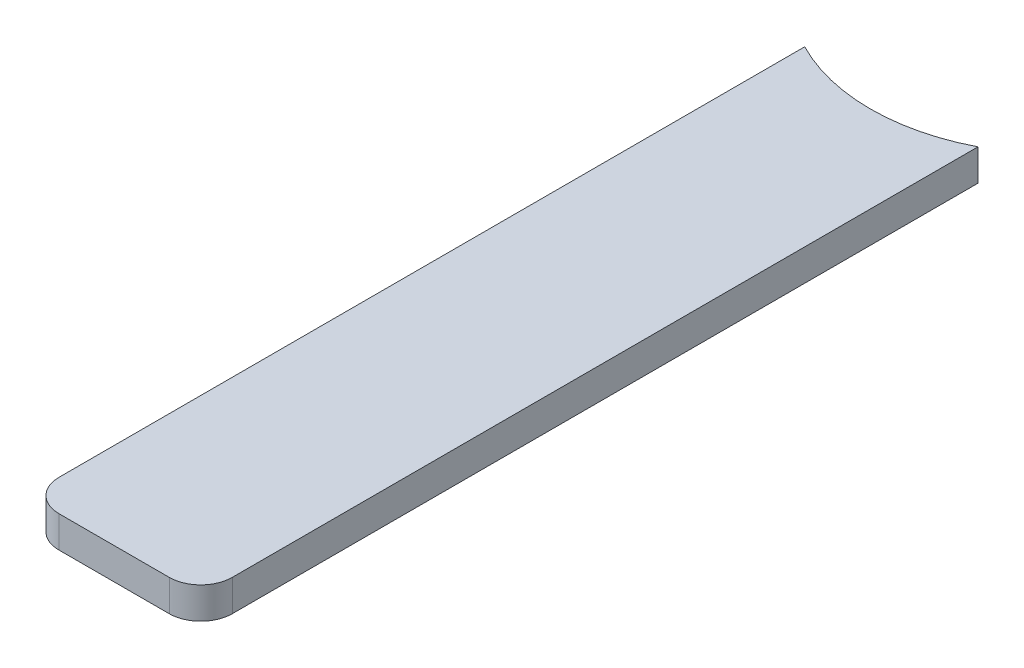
ISO-10303-21;
HEADER;
FILE_DESCRIPTION(('STEP AP214'),'2;1');
FILE_NAME('part.step','',(''),(''),'','','');
FILE_SCHEMA(('AUTOMOTIVE_DESIGN { 1 0 10303 214 1 1 1 1 }'));
ENDSEC;
DATA;
#1=APPLICATION_CONTEXT('core data for automotive mechanical design processes');
#2=APPLICATION_PROTOCOL_DEFINITION('international standard','automotive_design',2000,#1);
#3=PRODUCT_CONTEXT('',#1,'mechanical');
#4=PRODUCT('Part','Part','',(#3));
#5=PRODUCT_RELATED_PRODUCT_CATEGORY('part','',(#4));
#6=PRODUCT_DEFINITION_FORMATION('','',#4);
#7=PRODUCT_DEFINITION_CONTEXT('part definition',#1,'design');
#8=PRODUCT_DEFINITION('design','',#6,#7);
#9=PRODUCT_DEFINITION_SHAPE('','',#8);
#10=(LENGTH_UNIT() NAMED_UNIT(*) SI_UNIT(.MILLI.,.METRE.));
#11=(NAMED_UNIT(*) PLANE_ANGLE_UNIT() SI_UNIT($,.RADIAN.));
#12=(NAMED_UNIT(*) SI_UNIT($,.STERADIAN.) SOLID_ANGLE_UNIT());
#13=UNCERTAINTY_MEASURE_WITH_UNIT(LENGTH_MEASURE(1.E-05),#10,'distance_accuracy_value','');
#14=(GEOMETRIC_REPRESENTATION_CONTEXT(3) GLOBAL_UNCERTAINTY_ASSIGNED_CONTEXT((#13)) GLOBAL_UNIT_ASSIGNED_CONTEXT((#10,
#11,#12)) REPRESENTATION_CONTEXT('',''));
#15=CARTESIAN_POINT('',(0.,0.,0.));
#16=DIRECTION('',(0.,0.,1.));
#17=DIRECTION('',(1.,0.,0.));
#18=AXIS2_PLACEMENT_3D('',#15,#16,#17);
#19=CARTESIAN_POINT('',(0.,0.,0.));
#20=DIRECTION('',(0.,0.,1.));
#21=DIRECTION('',(1.,0.,0.));
#22=AXIS2_PLACEMENT_3D('',#19,#20,#21);
#23=PLANE('',#22);
#24=DIRECTION('',(1.,0.,0.));
#25=VECTOR('',#24,1.);
#26=CARTESIAN_POINT('',(-27.4999999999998,-836.402838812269,0.));
#27=LINE('',#26,#25);
#28=CARTESIAN_POINT('',(-17.4999999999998,-836.402838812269,0.));
#29=VERTEX_POINT('',#28);
#30=CARTESIAN_POINT('',(17.5000000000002,-836.402838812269,0.));
#31=VERTEX_POINT('',#30);
#32=EDGE_CURVE('E131',#29,#31,#27,.T.);
#33=ORIENTED_EDGE('',*,*,#32,.T.);
#34=DIRECTION('',(0.,1.,0.));
#35=VECTOR('',#34,1.);
#36=CARTESIAN_POINT('',(17.5000000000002,0.,0.));
#37=LINE('',#36,#35);
#38=CARTESIAN_POINT('',(17.5000000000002,-826.402838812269,0.));
#39=VERTEX_POINT('',#38);
#40=EDGE_CURVE('E119',#31,#39,#37,.T.);
#41=ORIENTED_EDGE('',*,*,#40,.T.);
#42=DIRECTION('',(-1.,0.,0.));
#43=VECTOR('',#42,1.);
#44=CARTESIAN_POINT('',(-27.4999999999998,-826.402838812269,0.));
#45=LINE('',#44,#43);
#46=CARTESIAN_POINT('',(-17.4999999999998,-826.402838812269,0.));
#47=VERTEX_POINT('',#46);
#48=EDGE_CURVE('E137',#39,#47,#45,.T.);
#49=ORIENTED_EDGE('',*,*,#48,.T.);
#50=DIRECTION('',(0.,-1.,0.));
#51=VECTOR('',#50,1.);
#52=CARTESIAN_POINT('',(-17.4999999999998,0.,0.));
#53=LINE('',#52,#51);
#54=EDGE_CURVE('E116',#47,#29,#53,.T.);
#55=ORIENTED_EDGE('',*,*,#54,.T.);
#56=EDGE_LOOP('',(#33,#41,#49,#55));
#57=FACE_BOUND('',#56,.T.);
#58=ADVANCED_FACE('F35',(#57),#23,.T.);
#59=CARTESIAN_POINT('',(-27.4999999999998,-826.402838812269,-360.001));
#60=DIRECTION('',(0.,1.,0.));
#61=DIRECTION('',(0.,0.,1.));
#62=AXIS2_PLACEMENT_3D('',#59,#60,#61);
#63=PLANE('',#62);
#64=ORIENTED_EDGE('',*,*,#48,.F.);
#65=CARTESIAN_POINT('',(17.5000000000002,-826.402838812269,-10.));
#66=DIRECTION('',(0.,1.,0.));
#67=DIRECTION('',(0.,0.,1.));
#68=AXIS2_PLACEMENT_3D('',#65,#66,#67);
#69=CIRCLE('',#68,10.);
#70=CARTESIAN_POINT('',(27.5000000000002,-826.402838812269,-10.0000000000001));
#71=VERTEX_POINT('',#70);
#72=EDGE_CURVE('E125',#39,#71,#69,.T.);
#73=ORIENTED_EDGE('',*,*,#72,.T.);
#74=DIRECTION('',(0.,0.,1.));
#75=VECTOR('',#74,1.);
#76=CARTESIAN_POINT('',(27.5000000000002,-826.402838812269,-360.001));
#77=LINE('',#76,#75);
#78=CARTESIAN_POINT('',(27.5000000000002,-826.402838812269,-246.673177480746));
#79=VERTEX_POINT('',#78);
#80=EDGE_CURVE('E106',#79,#71,#77,.T.);
#81=ORIENTED_EDGE('',*,*,#80,.F.);
#82=CARTESIAN_POINT('',(3.19513458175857E-13,-826.402838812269,-300.));
#83=DIRECTION('',(0.,1.,0.));
#84=DIRECTION('',(0.,0.,1.));
#85=AXIS2_PLACEMENT_3D('',#82,#83,#84);
#86=CIRCLE('',#85,60.0000000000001);
#87=CARTESIAN_POINT('',(-27.4999999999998,-826.402838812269,-246.673177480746));
#88=VERTEX_POINT('',#87);
#89=EDGE_CURVE('E93',#79,#88,#86,.F.);
#90=ORIENTED_EDGE('',*,*,#89,.T.);
#91=DIRECTION('',(0.,0.,1.));
#92=VECTOR('',#91,1.);
#93=CARTESIAN_POINT('',(-27.4999999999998,-826.402838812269,-360.001));
#94=LINE('',#93,#92);
#95=CARTESIAN_POINT('',(-27.4999999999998,-826.402838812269,-10.0000000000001));
#96=VERTEX_POINT('',#95);
#97=EDGE_CURVE('E100',#88,#96,#94,.T.);
#98=ORIENTED_EDGE('',*,*,#97,.T.);
#99=CARTESIAN_POINT('',(-17.4999999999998,-826.402838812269,-10.));
#100=DIRECTION('',(0.,1.,0.));
#101=DIRECTION('',(0.,0.,1.));
#102=AXIS2_PLACEMENT_3D('',#99,#100,#101);
#103=CIRCLE('',#102,10.);
#104=EDGE_CURVE('E123',#96,#47,#103,.T.);
#105=ORIENTED_EDGE('',*,*,#104,.T.);
#106=EDGE_LOOP('',(#64,#73,#81,#90,#98,#105));
#107=FACE_BOUND('',#106,.T.);
#108=ADVANCED_FACE('F110',(#107),#63,.T.);
#109=CARTESIAN_POINT('',(-27.4999999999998,-826.402838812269,-360.001));
#110=DIRECTION('',(-1.,0.,0.));
#111=DIRECTION('',(0.,0.,1.));
#112=AXIS2_PLACEMENT_3D('',#109,#110,#111);
#113=PLANE('',#112);
#114=DIRECTION('',(0.,0.,1.));
#115=VECTOR('',#114,1.);
#116=CARTESIAN_POINT('',(-27.4999999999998,-836.402838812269,-360.001));
#117=LINE('',#116,#115);
#118=CARTESIAN_POINT('',(-27.4999999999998,-836.402838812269,-246.673177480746));
#119=VERTEX_POINT('',#118);
#120=CARTESIAN_POINT('',(-27.4999999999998,-836.402838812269,-10.0000000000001));
#121=VERTEX_POINT('',#120);
#122=EDGE_CURVE('E105',#119,#121,#117,.T.);
#123=ORIENTED_EDGE('',*,*,#122,.T.);
#124=DIRECTION('',(0.,-1.,0.));
#125=VECTOR('',#124,1.);
#126=CARTESIAN_POINT('',(-27.4999999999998,-826.402838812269,-10.));
#127=LINE('',#126,#125);
#128=EDGE_CURVE('E11',#121,#96,#127,.F.);
#129=ORIENTED_EDGE('',*,*,#128,.T.);
#130=ORIENTED_EDGE('',*,*,#97,.F.);
#131=DIRECTION('',(0.,-1.,0.));
#132=VECTOR('',#131,1.);
#133=CARTESIAN_POINT('',(-27.4999999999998,-409.402838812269,-246.673177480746));
#134=LINE('',#133,#132);
#135=EDGE_CURVE('E89',#88,#119,#134,.T.);
#136=ORIENTED_EDGE('',*,*,#135,.T.);
#137=EDGE_LOOP('',(#123,#129,#130,#136));
#138=FACE_BOUND('',#137,.T.);
#139=ADVANCED_FACE('F101',(#138),#113,.T.);
#140=CARTESIAN_POINT('',(-27.4999999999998,-836.402838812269,-360.001));
#141=DIRECTION('',(0.,-1.,0.));
#142=DIRECTION('',(0.,0.,-1.));
#143=AXIS2_PLACEMENT_3D('',#140,#141,#142);
#144=PLANE('',#143);
#145=DIRECTION('',(0.,0.,1.));
#146=VECTOR('',#145,1.);
#147=CARTESIAN_POINT('',(27.5000000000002,-836.402838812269,-360.001));
#148=LINE('',#147,#146);
#149=CARTESIAN_POINT('',(27.5000000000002,-836.402838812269,-246.673177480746));
#150=VERTEX_POINT('',#149);
#151=CARTESIAN_POINT('',(27.5000000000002,-836.402838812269,-10.0000000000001));
#152=VERTEX_POINT('',#151);
#153=EDGE_CURVE('E111',#150,#152,#148,.T.);
#154=ORIENTED_EDGE('',*,*,#153,.T.);
#155=CARTESIAN_POINT('',(17.5000000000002,-836.402838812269,-10.));
#156=DIRECTION('',(0.,-1.,0.));
#157=DIRECTION('',(0.,0.,-1.));
#158=AXIS2_PLACEMENT_3D('',#155,#156,#157);
#159=CIRCLE('',#158,10.);
#160=EDGE_CURVE('E43',#152,#31,#159,.T.);
#161=ORIENTED_EDGE('',*,*,#160,.T.);
#162=ORIENTED_EDGE('',*,*,#32,.F.);
#163=CARTESIAN_POINT('',(-17.4999999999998,-836.402838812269,-10.));
#164=DIRECTION('',(0.,-1.,0.));
#165=DIRECTION('',(0.,0.,-1.));
#166=AXIS2_PLACEMENT_3D('',#163,#164,#165);
#167=CIRCLE('',#166,10.);
#168=EDGE_CURVE('E50',#29,#121,#167,.T.);
#169=ORIENTED_EDGE('',*,*,#168,.T.);
#170=ORIENTED_EDGE('',*,*,#122,.F.);
#171=CARTESIAN_POINT('',(3.18680790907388E-13,-836.402838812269,-300.));
#172=DIRECTION('',(0.,-1.,0.));
#173=DIRECTION('',(0.,0.,-1.));
#174=AXIS2_PLACEMENT_3D('',#171,#172,#173);
#175=CIRCLE('',#174,60.0000000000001);
#176=EDGE_CURVE('E96',#119,#150,#175,.F.);
#177=ORIENTED_EDGE('',*,*,#176,.T.);
#178=EDGE_LOOP('',(#154,#161,#162,#169,#170,#177));
#179=FACE_BOUND('',#178,.T.);
#180=ADVANCED_FACE('F130',(#179),#144,.T.);
#181=CARTESIAN_POINT('',(27.5000000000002,-826.402838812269,-360.001));
#182=DIRECTION('',(1.,0.,0.));
#183=DIRECTION('',(0.,0.,-1.));
#184=AXIS2_PLACEMENT_3D('',#181,#182,#183);
#185=PLANE('',#184);
#186=ORIENTED_EDGE('',*,*,#80,.T.);
#187=DIRECTION('',(0.,1.,0.));
#188=VECTOR('',#187,1.);
#189=CARTESIAN_POINT('',(27.5000000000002,-826.402838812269,-10.));
#190=LINE('',#189,#188);
#191=EDGE_CURVE('E58',#71,#152,#190,.F.);
#192=ORIENTED_EDGE('',*,*,#191,.T.);
#193=ORIENTED_EDGE('',*,*,#153,.F.);
#194=DIRECTION('',(0.,-1.,0.));
#195=VECTOR('',#194,1.);
#196=CARTESIAN_POINT('',(27.5000000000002,-409.402838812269,-246.673177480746));
#197=LINE('',#196,#195);
#198=EDGE_CURVE('E120',#150,#79,#197,.F.);
#199=ORIENTED_EDGE('',*,*,#198,.T.);
#200=EDGE_LOOP('',(#186,#192,#193,#199));
#201=FACE_BOUND('',#200,.T.);
#202=ADVANCED_FACE('F140',(#201),#185,.T.);
#203=CARTESIAN_POINT('',(3.54235683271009E-13,-409.402838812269,-300.));
#204=DIRECTION('',(0.,-1.,0.));
#205=DIRECTION('',(-1.,0.,0.));
#206=AXIS2_PLACEMENT_3D('',#203,#204,#205);
#207=CYLINDRICAL_SURFACE('',#206,60.0000000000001);
#208=ORIENTED_EDGE('',*,*,#176,.F.);
#209=ORIENTED_EDGE('',*,*,#135,.F.);
#210=ORIENTED_EDGE('',*,*,#89,.F.);
#211=ORIENTED_EDGE('',*,*,#198,.F.);
#212=EDGE_LOOP('',(#208,#209,#210,#211));
#213=FACE_BOUND('',#212,.T.);
#214=ADVANCED_FACE('F91',(#213),#207,.F.);
#215=CARTESIAN_POINT('',(17.5000000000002,0.,-10.));
#216=DIRECTION('',(0.,1.,0.));
#217=DIRECTION('',(0.,0.,1.));
#218=AXIS2_PLACEMENT_3D('',#215,#216,#217);
#219=CYLINDRICAL_SURFACE('',#218,10.);
#220=ORIENTED_EDGE('',*,*,#160,.F.);
#221=ORIENTED_EDGE('',*,*,#191,.F.);
#222=ORIENTED_EDGE('',*,*,#72,.F.);
#223=ORIENTED_EDGE('',*,*,#40,.F.);
#224=EDGE_LOOP('',(#220,#221,#222,#223));
#225=FACE_BOUND('',#224,.T.);
#226=ADVANCED_FACE('F139',(#225),#219,.T.);
#227=CARTESIAN_POINT('',(-17.4999999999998,0.,-10.));
#228=DIRECTION('',(0.,-1.,0.));
#229=DIRECTION('',(0.,0.,-1.));
#230=AXIS2_PLACEMENT_3D('',#227,#228,#229);
#231=CYLINDRICAL_SURFACE('',#230,10.);
#232=ORIENTED_EDGE('',*,*,#104,.F.);
#233=ORIENTED_EDGE('',*,*,#128,.F.);
#234=ORIENTED_EDGE('',*,*,#168,.F.);
#235=ORIENTED_EDGE('',*,*,#54,.F.);
#236=EDGE_LOOP('',(#232,#233,#234,#235));
#237=FACE_BOUND('',#236,.T.);
#238=ADVANCED_FACE('F37',(#237),#231,.T.);
#239=CLOSED_SHELL('',(#58,#108,#139,#180,#202,#214,#226,#238));
#240=MANIFOLD_SOLID_BREP('B2',#239);
#241=ADVANCED_BREP_SHAPE_REPRESENTATION('',(#18,#240),#14);
#242=SHAPE_DEFINITION_REPRESENTATION(#9,#241);
ENDSEC;
END-ISO-10303-21;
